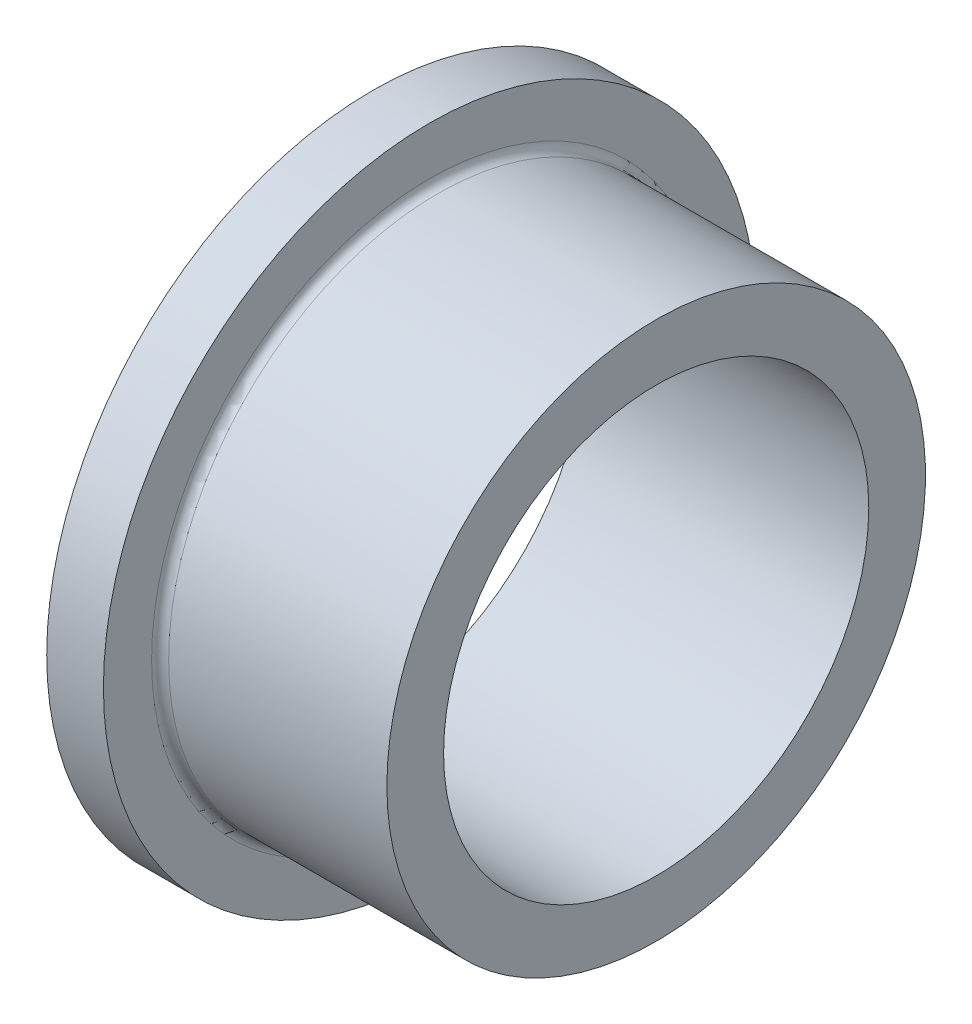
ISO-10303-21;
HEADER;
FILE_DESCRIPTION(('STEP AP214'),'2;1');
FILE_NAME('part.step','',(''),(''),'','','');
FILE_SCHEMA(('AUTOMOTIVE_DESIGN { 1 0 10303 214 1 1 1 1 }'));
ENDSEC;
DATA;
#1=APPLICATION_CONTEXT('core data for automotive mechanical design processes');
#2=APPLICATION_PROTOCOL_DEFINITION('international standard','automotive_design',2000,#1);
#3=PRODUCT_CONTEXT('',#1,'mechanical');
#4=PRODUCT('Part','Part','',(#3));
#5=PRODUCT_RELATED_PRODUCT_CATEGORY('part','',(#4));
#6=PRODUCT_DEFINITION_FORMATION('','',#4);
#7=PRODUCT_DEFINITION_CONTEXT('part definition',#1,'design');
#8=PRODUCT_DEFINITION('design','',#6,#7);
#9=PRODUCT_DEFINITION_SHAPE('','',#8);
#10=(LENGTH_UNIT() NAMED_UNIT(*) SI_UNIT(.MILLI.,.METRE.));
#11=(NAMED_UNIT(*) PLANE_ANGLE_UNIT() SI_UNIT($,.RADIAN.));
#12=(NAMED_UNIT(*) SI_UNIT($,.STERADIAN.) SOLID_ANGLE_UNIT());
#13=UNCERTAINTY_MEASURE_WITH_UNIT(LENGTH_MEASURE(1.E-05),#10,'distance_accuracy_value','');
#14=(GEOMETRIC_REPRESENTATION_CONTEXT(3) GLOBAL_UNCERTAINTY_ASSIGNED_CONTEXT((#13)) GLOBAL_UNIT_ASSIGNED_CONTEXT((#10,
#11,#12)) REPRESENTATION_CONTEXT('',''));
#15=CARTESIAN_POINT('',(0.,0.,0.));
#16=DIRECTION('',(0.,0.,1.));
#17=DIRECTION('',(1.,0.,0.));
#18=AXIS2_PLACEMENT_3D('',#15,#16,#17);
#19=CARTESIAN_POINT('',(0.,0.,0.));
#20=DIRECTION('',(-1.,0.,0.));
#21=DIRECTION('',(0.,0.,1.));
#22=AXIS2_PLACEMENT_3D('',#19,#20,#21);
#23=CYLINDRICAL_SURFACE('',#22,15.);
#24=CARTESIAN_POINT('',(20.,0.,0.));
#25=DIRECTION('',(-1.,0.,0.));
#26=DIRECTION('',(0.,0.,1.));
#27=AXIS2_PLACEMENT_3D('',#24,#25,#26);
#28=CIRCLE('',#27,15.);
#29=CARTESIAN_POINT('',(20.,0.,15.));
#30=VERTEX_POINT('',#29);
#31=EDGE_CURVE('E58',#30,#30,#28,.T.);
#32=ORIENTED_EDGE('',*,*,#31,.F.);
#33=EDGE_LOOP('',(#32));
#34=FACE_BOUND('',#33,.T.);
#35=CARTESIAN_POINT('',(0.,0.,0.));
#36=DIRECTION('',(-1.,0.,0.));
#37=DIRECTION('',(0.,0.,1.));
#38=AXIS2_PLACEMENT_3D('',#35,#36,#37);
#39=CIRCLE('',#38,15.);
#40=CARTESIAN_POINT('',(0.,0.,15.));
#41=VERTEX_POINT('',#40);
#42=EDGE_CURVE('E10',#41,#41,#39,.T.);
#43=ORIENTED_EDGE('',*,*,#42,.T.);
#44=EDGE_LOOP('',(#43));
#45=FACE_BOUND('',#44,.T.);
#46=ADVANCED_FACE('F33',(#34,#45),#23,.F.);
#47=CARTESIAN_POINT('',(0.,23.,0.));
#48=DIRECTION('',(1.,0.,0.));
#49=DIRECTION('',(0.,0.,-1.));
#50=AXIS2_PLACEMENT_3D('',#47,#48,#49);
#51=PLANE('',#50);
#52=ORIENTED_EDGE('',*,*,#42,.F.);
#53=EDGE_LOOP('',(#52));
#54=FACE_BOUND('',#53,.T.);
#55=CARTESIAN_POINT('',(0.,0.,0.));
#56=DIRECTION('',(-1.,0.,0.));
#57=DIRECTION('',(0.,0.,1.));
#58=AXIS2_PLACEMENT_3D('',#55,#56,#57);
#59=CIRCLE('',#58,23.);
#60=CARTESIAN_POINT('',(0.,0.,23.));
#61=VERTEX_POINT('',#60);
#62=EDGE_CURVE('E39',#61,#61,#59,.T.);
#63=ORIENTED_EDGE('',*,*,#62,.T.);
#64=EDGE_LOOP('',(#63));
#65=FACE_BOUND('',#64,.T.);
#66=ADVANCED_FACE('F65',(#54,#65),#51,.F.);
#67=CARTESIAN_POINT('',(0.,0.,0.));
#68=DIRECTION('',(-1.,0.,0.));
#69=DIRECTION('',(0.,0.,1.));
#70=AXIS2_PLACEMENT_3D('',#67,#68,#69);
#71=CYLINDRICAL_SURFACE('',#70,23.);
#72=ORIENTED_EDGE('',*,*,#62,.F.);
#73=EDGE_LOOP('',(#72));
#74=FACE_BOUND('',#73,.T.);
#75=CARTESIAN_POINT('',(4.,0.,0.));
#76=DIRECTION('',(-1.,0.,0.));
#77=DIRECTION('',(0.,0.,1.));
#78=AXIS2_PLACEMENT_3D('',#75,#76,#77);
#79=CIRCLE('',#78,23.);
#80=CARTESIAN_POINT('',(4.,0.,23.));
#81=VERTEX_POINT('',#80);
#82=EDGE_CURVE('E43',#81,#81,#79,.T.);
#83=ORIENTED_EDGE('',*,*,#82,.T.);
#84=EDGE_LOOP('',(#83));
#85=FACE_BOUND('',#84,.T.);
#86=ADVANCED_FACE('F69',(#74,#85),#71,.T.);
#87=CARTESIAN_POINT('',(4.,19.6,0.));
#88=DIRECTION('',(-1.,0.,0.));
#89=DIRECTION('',(0.,0.,1.));
#90=AXIS2_PLACEMENT_3D('',#87,#88,#89);
#91=PLANE('',#90);
#92=ORIENTED_EDGE('',*,*,#82,.F.);
#93=EDGE_LOOP('',(#92));
#94=FACE_BOUND('',#93,.T.);
#95=CARTESIAN_POINT('',(4.,0.,0.));
#96=DIRECTION('',(-1.,0.,0.));
#97=DIRECTION('',(0.,0.,1.));
#98=AXIS2_PLACEMENT_3D('',#95,#96,#97);
#99=CIRCLE('',#98,19.6);
#100=CARTESIAN_POINT('',(4.,0.,19.6));
#101=VERTEX_POINT('',#100);
#102=EDGE_CURVE('E47',#101,#101,#99,.T.);
#103=ORIENTED_EDGE('',*,*,#102,.T.);
#104=EDGE_LOOP('',(#103));
#105=FACE_BOUND('',#104,.T.);
#106=ADVANCED_FACE('F74',(#94,#105),#91,.F.);
#107=CARTESIAN_POINT('',(4.6,0.,0.));
#108=DIRECTION('',(-1.,0.,0.));
#109=DIRECTION('',(0.,0.,1.));
#110=AXIS2_PLACEMENT_3D('',#107,#108,#109);
#111=TOROIDAL_SURFACE('',#110,19.6,0.6);
#112=ORIENTED_EDGE('',*,*,#102,.F.);
#113=EDGE_LOOP('',(#112));
#114=FACE_BOUND('',#113,.T.);
#115=CARTESIAN_POINT('',(4.6,0.,0.));
#116=DIRECTION('',(-1.,0.,0.));
#117=DIRECTION('',(0.,0.,1.));
#118=AXIS2_PLACEMENT_3D('',#115,#116,#117);
#119=CIRCLE('',#118,19.);
#120=CARTESIAN_POINT('',(4.6,0.,19.));
#121=VERTEX_POINT('',#120);
#122=EDGE_CURVE('E52',#121,#121,#119,.T.);
#123=ORIENTED_EDGE('',*,*,#122,.T.);
#124=EDGE_LOOP('',(#123));
#125=FACE_BOUND('',#124,.T.);
#126=ADVANCED_FACE('F80',(#114,#125),#111,.F.);
#127=CARTESIAN_POINT('',(0.,0.,0.));
#128=DIRECTION('',(-1.,0.,0.));
#129=DIRECTION('',(0.,0.,1.));
#130=AXIS2_PLACEMENT_3D('',#127,#128,#129);
#131=CYLINDRICAL_SURFACE('',#130,19.);
#132=ORIENTED_EDGE('',*,*,#122,.F.);
#133=EDGE_LOOP('',(#132));
#134=FACE_BOUND('',#133,.T.);
#135=CARTESIAN_POINT('',(20.,0.,0.));
#136=DIRECTION('',(-1.,0.,0.));
#137=DIRECTION('',(0.,0.,1.));
#138=AXIS2_PLACEMENT_3D('',#135,#136,#137);
#139=CIRCLE('',#138,19.);
#140=CARTESIAN_POINT('',(20.,0.,19.));
#141=VERTEX_POINT('',#140);
#142=EDGE_CURVE('E55',#141,#141,#139,.T.);
#143=ORIENTED_EDGE('',*,*,#142,.T.);
#144=EDGE_LOOP('',(#143));
#145=FACE_BOUND('',#144,.T.);
#146=ADVANCED_FACE('F84',(#134,#145),#131,.T.);
#147=CARTESIAN_POINT('',(20.,19.,0.));
#148=DIRECTION('',(-1.,0.,0.));
#149=DIRECTION('',(0.,0.,1.));
#150=AXIS2_PLACEMENT_3D('',#147,#148,#149);
#151=PLANE('',#150);
#152=ORIENTED_EDGE('',*,*,#142,.F.);
#153=EDGE_LOOP('',(#152));
#154=FACE_BOUND('',#153,.T.);
#155=ORIENTED_EDGE('',*,*,#31,.T.);
#156=EDGE_LOOP('',(#155));
#157=FACE_BOUND('',#156,.T.);
#158=ADVANCED_FACE('F62',(#154,#157),#151,.F.);
#159=CLOSED_SHELL('',(#46,#66,#86,#106,#126,#146,#158));
#160=MANIFOLD_SOLID_BREP('B2',#159);
#161=ADVANCED_BREP_SHAPE_REPRESENTATION('',(#18,#160),#14);
#162=SHAPE_DEFINITION_REPRESENTATION(#9,#161);
ENDSEC;
END-ISO-10303-21;
